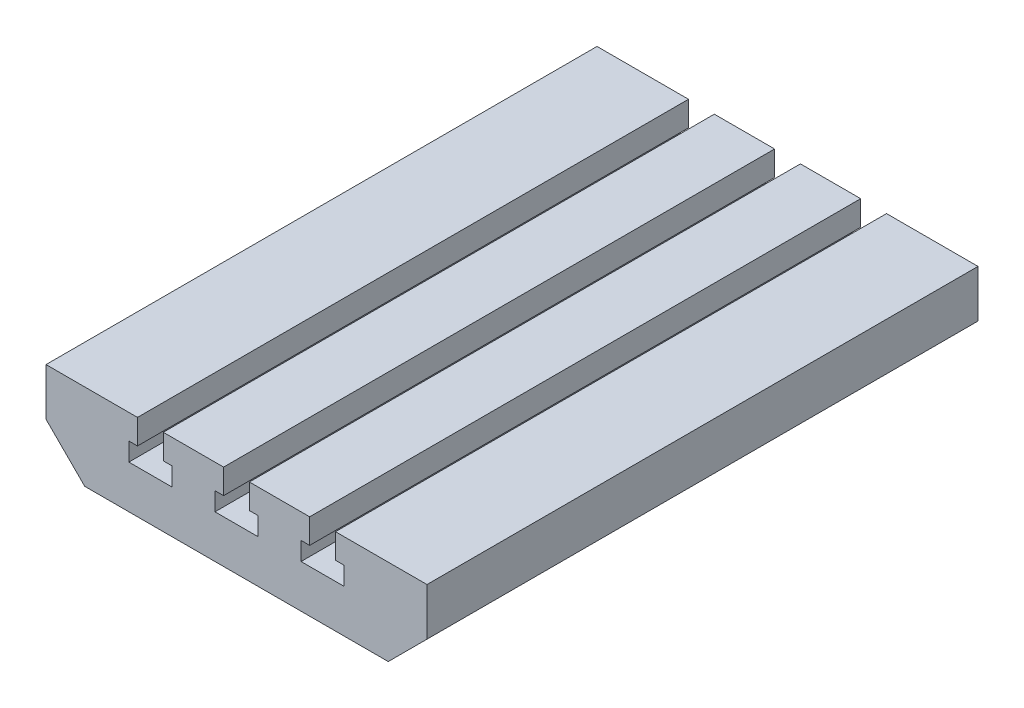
ISO-10303-21;
HEADER;
FILE_DESCRIPTION(('STEP AP214'),'2;1');
FILE_NAME('part.step','',(''),(''),'','','');
FILE_SCHEMA(('AUTOMOTIVE_DESIGN { 1 0 10303 214 1 1 1 1 }'));
ENDSEC;
DATA;
#1=APPLICATION_CONTEXT('core data for automotive mechanical design processes');
#2=APPLICATION_PROTOCOL_DEFINITION('international standard','automotive_design',2000,#1);
#3=PRODUCT_CONTEXT('',#1,'mechanical');
#4=PRODUCT('Part','Part','',(#3));
#5=PRODUCT_RELATED_PRODUCT_CATEGORY('part','',(#4));
#6=PRODUCT_DEFINITION_FORMATION('','',#4);
#7=PRODUCT_DEFINITION_CONTEXT('part definition',#1,'design');
#8=PRODUCT_DEFINITION('design','',#6,#7);
#9=PRODUCT_DEFINITION_SHAPE('','',#8);
#10=(LENGTH_UNIT() NAMED_UNIT(*) SI_UNIT(.MILLI.,.METRE.));
#11=(NAMED_UNIT(*) PLANE_ANGLE_UNIT() SI_UNIT($,.RADIAN.));
#12=(NAMED_UNIT(*) SI_UNIT($,.STERADIAN.) SOLID_ANGLE_UNIT());
#13=UNCERTAINTY_MEASURE_WITH_UNIT(LENGTH_MEASURE(1.E-05),#10,'distance_accuracy_value','');
#14=(GEOMETRIC_REPRESENTATION_CONTEXT(3) GLOBAL_UNCERTAINTY_ASSIGNED_CONTEXT((#13)) GLOBAL_UNIT_ASSIGNED_CONTEXT((#10,
#11,#12)) REPRESENTATION_CONTEXT('',''));
#15=CARTESIAN_POINT('',(0.,0.,0.));
#16=DIRECTION('',(0.,0.,1.));
#17=DIRECTION('',(1.,0.,0.));
#18=AXIS2_PLACEMENT_3D('',#15,#16,#17);
#19=CARTESIAN_POINT('',(-88.5,40.,256.));
#20=DIRECTION('',(1.,0.,0.));
#21=DIRECTION('',(0.,1.,0.));
#22=AXIS2_PLACEMENT_3D('',#19,#20,#21);
#23=PLANE('',#22);
#24=DIRECTION('',(0.,-1.,0.));
#25=VECTOR('',#24,1.);
#26=CARTESIAN_POINT('',(-88.5,40.,0.));
#27=LINE('',#26,#25);
#28=CARTESIAN_POINT('',(-88.5,40.,0.));
#29=VERTEX_POINT('',#28);
#30=CARTESIAN_POINT('',(-88.5,18.,0.));
#31=VERTEX_POINT('',#30);
#32=EDGE_CURVE('E268',#29,#31,#27,.T.);
#33=ORIENTED_EDGE('',*,*,#32,.T.);
#34=DIRECTION('',(0.,0.,-1.));
#35=VECTOR('',#34,1.);
#36=CARTESIAN_POINT('',(-88.5,18.,256.));
#37=LINE('',#36,#35);
#38=CARTESIAN_POINT('',(-88.5,18.,256.));
#39=VERTEX_POINT('',#38);
#40=EDGE_CURVE('E11',#39,#31,#37,.T.);
#41=ORIENTED_EDGE('',*,*,#40,.F.);
#42=DIRECTION('',(0.,-1.,0.));
#43=VECTOR('',#42,1.);
#44=CARTESIAN_POINT('',(-88.5,40.,256.));
#45=LINE('',#44,#43);
#46=CARTESIAN_POINT('',(-88.5,40.,256.));
#47=VERTEX_POINT('',#46);
#48=EDGE_CURVE('E326',#47,#39,#45,.T.);
#49=ORIENTED_EDGE('',*,*,#48,.F.);
#50=DIRECTION('',(0.,0.,-1.));
#51=VECTOR('',#50,1.);
#52=CARTESIAN_POINT('',(-88.5,40.,256.));
#53=LINE('',#52,#51);
#54=EDGE_CURVE('E264',#47,#29,#53,.T.);
#55=ORIENTED_EDGE('',*,*,#54,.T.);
#56=EDGE_LOOP('',(#33,#41,#49,#55));
#57=FACE_BOUND('',#56,.T.);
#58=ADVANCED_FACE('F40',(#57),#23,.F.);
#59=CARTESIAN_POINT('',(-70.5,0.,256.));
#60=DIRECTION('',(0.707106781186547,0.707106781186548,0.));
#61=DIRECTION('',(-0.707106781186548,0.707106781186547,0.));
#62=AXIS2_PLACEMENT_3D('',#59,#60,#61);
#63=PLANE('',#62);
#64=DIRECTION('',(0.707106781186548,-0.707106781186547,0.));
#65=VECTOR('',#64,1.);
#66=CARTESIAN_POINT('',(-70.5,0.,0.));
#67=LINE('',#66,#65);
#68=CARTESIAN_POINT('',(-70.5,0.,0.));
#69=VERTEX_POINT('',#68);
#70=EDGE_CURVE('E271',#31,#69,#67,.T.);
#71=ORIENTED_EDGE('',*,*,#70,.T.);
#72=DIRECTION('',(0.,0.,-1.));
#73=VECTOR('',#72,1.);
#74=CARTESIAN_POINT('',(-70.5,0.,256.));
#75=LINE('',#74,#73);
#76=CARTESIAN_POINT('',(-70.5,0.,256.));
#77=VERTEX_POINT('',#76);
#78=EDGE_CURVE('E48',#77,#69,#75,.T.);
#79=ORIENTED_EDGE('',*,*,#78,.F.);
#80=DIRECTION('',(0.707106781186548,-0.707106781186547,0.));
#81=VECTOR('',#80,1.);
#82=CARTESIAN_POINT('',(-70.5,0.,256.));
#83=LINE('',#82,#81);
#84=EDGE_CURVE('E165',#39,#77,#83,.T.);
#85=ORIENTED_EDGE('',*,*,#84,.F.);
#86=ORIENTED_EDGE('',*,*,#40,.T.);
#87=EDGE_LOOP('',(#71,#79,#85,#86));
#88=FACE_BOUND('',#87,.T.);
#89=ADVANCED_FACE('F494',(#88),#63,.F.);
#90=CARTESIAN_POINT('',(70.5,0.,256.));
#91=DIRECTION('',(0.,1.,0.));
#92=DIRECTION('',(-1.,0.,0.));
#93=AXIS2_PLACEMENT_3D('',#90,#91,#92);
#94=PLANE('',#93);
#95=DIRECTION('',(1.,0.,0.));
#96=VECTOR('',#95,1.);
#97=CARTESIAN_POINT('',(70.5,0.,0.));
#98=LINE('',#97,#96);
#99=CARTESIAN_POINT('',(70.5,0.,0.));
#100=VERTEX_POINT('',#99);
#101=EDGE_CURVE('E273',#69,#100,#98,.T.);
#102=ORIENTED_EDGE('',*,*,#101,.T.);
#103=DIRECTION('',(0.,0.,-1.));
#104=VECTOR('',#103,1.);
#105=CARTESIAN_POINT('',(70.5,0.,256.));
#106=LINE('',#105,#104);
#107=CARTESIAN_POINT('',(70.5,0.,256.));
#108=VERTEX_POINT('',#107);
#109=EDGE_CURVE('E399',#108,#100,#106,.T.);
#110=ORIENTED_EDGE('',*,*,#109,.F.);
#111=DIRECTION('',(1.,0.,0.));
#112=VECTOR('',#111,1.);
#113=CARTESIAN_POINT('',(70.5,0.,256.));
#114=LINE('',#113,#112);
#115=EDGE_CURVE('E407',#77,#108,#114,.T.);
#116=ORIENTED_EDGE('',*,*,#115,.F.);
#117=ORIENTED_EDGE('',*,*,#78,.T.);
#118=EDGE_LOOP('',(#102,#110,#116,#117));
#119=FACE_BOUND('',#118,.T.);
#120=ADVANCED_FACE('F405',(#119),#94,.F.);
#121=CARTESIAN_POINT('',(88.5,18.,256.));
#122=DIRECTION('',(-0.707106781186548,0.707106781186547,0.));
#123=DIRECTION('',(-0.707106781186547,-0.707106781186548,0.));
#124=AXIS2_PLACEMENT_3D('',#121,#122,#123);
#125=PLANE('',#124);
#126=DIRECTION('',(0.707106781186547,0.707106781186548,0.));
#127=VECTOR('',#126,1.);
#128=CARTESIAN_POINT('',(88.5,18.,0.));
#129=LINE('',#128,#127);
#130=CARTESIAN_POINT('',(88.5,18.,0.));
#131=VERTEX_POINT('',#130);
#132=EDGE_CURVE('E275',#100,#131,#129,.T.);
#133=ORIENTED_EDGE('',*,*,#132,.T.);
#134=DIRECTION('',(0.,0.,-1.));
#135=VECTOR('',#134,1.);
#136=CARTESIAN_POINT('',(88.5,18.,256.));
#137=LINE('',#136,#135);
#138=CARTESIAN_POINT('',(88.5,18.,256.));
#139=VERTEX_POINT('',#138);
#140=EDGE_CURVE('E396',#139,#131,#137,.T.);
#141=ORIENTED_EDGE('',*,*,#140,.F.);
#142=DIRECTION('',(0.707106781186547,0.707106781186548,0.));
#143=VECTOR('',#142,1.);
#144=CARTESIAN_POINT('',(88.5,18.,256.));
#145=LINE('',#144,#143);
#146=EDGE_CURVE('E425',#108,#139,#145,.T.);
#147=ORIENTED_EDGE('',*,*,#146,.F.);
#148=ORIENTED_EDGE('',*,*,#109,.T.);
#149=EDGE_LOOP('',(#133,#141,#147,#148));
#150=FACE_BOUND('',#149,.T.);
#151=ADVANCED_FACE('F416',(#150),#125,.F.);
#152=CARTESIAN_POINT('',(88.5,40.,256.));
#153=DIRECTION('',(-1.,0.,0.));
#154=DIRECTION('',(0.,0.,1.));
#155=AXIS2_PLACEMENT_3D('',#152,#153,#154);
#156=PLANE('',#155);
#157=DIRECTION('',(0.,1.,0.));
#158=VECTOR('',#157,1.);
#159=CARTESIAN_POINT('',(88.5,40.,0.));
#160=LINE('',#159,#158);
#161=CARTESIAN_POINT('',(88.5,40.,0.));
#162=VERTEX_POINT('',#161);
#163=EDGE_CURVE('E277',#131,#162,#160,.T.);
#164=ORIENTED_EDGE('',*,*,#163,.T.);
#165=DIRECTION('',(0.,0.,-1.));
#166=VECTOR('',#165,1.);
#167=CARTESIAN_POINT('',(88.5,40.,256.));
#168=LINE('',#167,#166);
#169=CARTESIAN_POINT('',(88.5,40.,256.));
#170=VERTEX_POINT('',#169);
#171=EDGE_CURVE('E393',#170,#162,#168,.T.);
#172=ORIENTED_EDGE('',*,*,#171,.F.);
#173=DIRECTION('',(0.,1.,0.));
#174=VECTOR('',#173,1.);
#175=CARTESIAN_POINT('',(88.5,40.,256.));
#176=LINE('',#175,#174);
#177=EDGE_CURVE('E422',#139,#170,#176,.T.);
#178=ORIENTED_EDGE('',*,*,#177,.F.);
#179=ORIENTED_EDGE('',*,*,#140,.T.);
#180=EDGE_LOOP('',(#164,#172,#178,#179));
#181=FACE_BOUND('',#180,.T.);
#182=ADVANCED_FACE('F420',(#181),#156,.F.);
#183=CARTESIAN_POINT('',(46.,40.,256.));
#184=DIRECTION('',(0.,-1.,0.));
#185=DIRECTION('',(1.,0.,0.));
#186=AXIS2_PLACEMENT_3D('',#183,#184,#185);
#187=PLANE('',#186);
#188=DIRECTION('',(-1.,0.,0.));
#189=VECTOR('',#188,1.);
#190=CARTESIAN_POINT('',(46.,40.,0.));
#191=LINE('',#190,#189);
#192=CARTESIAN_POINT('',(46.,40.,0.));
#193=VERTEX_POINT('',#192);
#194=EDGE_CURVE('E279',#162,#193,#191,.T.);
#195=ORIENTED_EDGE('',*,*,#194,.T.);
#196=DIRECTION('',(0.,0.,-1.));
#197=VECTOR('',#196,1.);
#198=CARTESIAN_POINT('',(46.,40.,256.));
#199=LINE('',#198,#197);
#200=CARTESIAN_POINT('',(46.,40.,256.));
#201=VERTEX_POINT('',#200);
#202=EDGE_CURVE('E390',#201,#193,#199,.T.);
#203=ORIENTED_EDGE('',*,*,#202,.F.);
#204=DIRECTION('',(-1.,0.,0.));
#205=VECTOR('',#204,1.);
#206=CARTESIAN_POINT('',(46.,40.,256.));
#207=LINE('',#206,#205);
#208=EDGE_CURVE('E424',#170,#201,#207,.T.);
#209=ORIENTED_EDGE('',*,*,#208,.F.);
#210=ORIENTED_EDGE('',*,*,#171,.T.);
#211=EDGE_LOOP('',(#195,#203,#209,#210));
#212=FACE_BOUND('',#211,.T.);
#213=ADVANCED_FACE('F507',(#212),#187,.F.);
#214=CARTESIAN_POINT('',(46.,28.5,256.));
#215=DIRECTION('',(1.,0.,0.));
#216=DIRECTION('',(0.,0.,-1.));
#217=AXIS2_PLACEMENT_3D('',#214,#215,#216);
#218=PLANE('',#217);
#219=DIRECTION('',(0.,-1.,0.));
#220=VECTOR('',#219,1.);
#221=CARTESIAN_POINT('',(46.,28.5,0.));
#222=LINE('',#221,#220);
#223=CARTESIAN_POINT('',(46.,28.5,0.));
#224=VERTEX_POINT('',#223);
#225=EDGE_CURVE('E281',#193,#224,#222,.T.);
#226=ORIENTED_EDGE('',*,*,#225,.T.);
#227=DIRECTION('',(0.,0.,-1.));
#228=VECTOR('',#227,1.);
#229=CARTESIAN_POINT('',(46.,28.5,256.));
#230=LINE('',#229,#228);
#231=CARTESIAN_POINT('',(46.,28.5,256.));
#232=VERTEX_POINT('',#231);
#233=EDGE_CURVE('E387',#232,#224,#230,.T.);
#234=ORIENTED_EDGE('',*,*,#233,.F.);
#235=DIRECTION('',(0.,-1.,0.));
#236=VECTOR('',#235,1.);
#237=CARTESIAN_POINT('',(46.,28.5,256.));
#238=LINE('',#237,#236);
#239=EDGE_CURVE('E427',#201,#232,#238,.T.);
#240=ORIENTED_EDGE('',*,*,#239,.F.);
#241=ORIENTED_EDGE('',*,*,#202,.T.);
#242=EDGE_LOOP('',(#226,#234,#240,#241));
#243=FACE_BOUND('',#242,.T.);
#244=ADVANCED_FACE('F510',(#243),#218,.F.);
#245=CARTESIAN_POINT('',(50.,28.5,256.));
#246=DIRECTION('',(0.,1.,0.));
#247=DIRECTION('',(0.,0.,1.));
#248=AXIS2_PLACEMENT_3D('',#245,#246,#247);
#249=PLANE('',#248);
#250=DIRECTION('',(1.,0.,0.));
#251=VECTOR('',#250,1.);
#252=CARTESIAN_POINT('',(50.,28.5,0.));
#253=LINE('',#252,#251);
#254=CARTESIAN_POINT('',(50.,28.5,0.));
#255=VERTEX_POINT('',#254);
#256=EDGE_CURVE('E283',#224,#255,#253,.T.);
#257=ORIENTED_EDGE('',*,*,#256,.T.);
#258=DIRECTION('',(0.,0.,-1.));
#259=VECTOR('',#258,1.);
#260=CARTESIAN_POINT('',(50.,28.5,256.));
#261=LINE('',#260,#259);
#262=CARTESIAN_POINT('',(50.,28.5,256.));
#263=VERTEX_POINT('',#262);
#264=EDGE_CURVE('E384',#263,#255,#261,.T.);
#265=ORIENTED_EDGE('',*,*,#264,.F.);
#266=DIRECTION('',(1.,0.,0.));
#267=VECTOR('',#266,1.);
#268=CARTESIAN_POINT('',(50.,28.5,256.));
#269=LINE('',#268,#267);
#270=EDGE_CURVE('E433',#232,#263,#269,.T.);
#271=ORIENTED_EDGE('',*,*,#270,.F.);
#272=ORIENTED_EDGE('',*,*,#233,.T.);
#273=EDGE_LOOP('',(#257,#265,#271,#272));
#274=FACE_BOUND('',#273,.T.);
#275=ADVANCED_FACE('F514',(#274),#249,.F.);
#276=CARTESIAN_POINT('',(50.,20.,256.));
#277=DIRECTION('',(1.,0.,0.));
#278=DIRECTION('',(0.,1.,0.));
#279=AXIS2_PLACEMENT_3D('',#276,#277,#278);
#280=PLANE('',#279);
#281=DIRECTION('',(0.,-1.,0.));
#282=VECTOR('',#281,1.);
#283=CARTESIAN_POINT('',(50.,20.,0.));
#284=LINE('',#283,#282);
#285=CARTESIAN_POINT('',(50.,20.,0.));
#286=VERTEX_POINT('',#285);
#287=EDGE_CURVE('E285',#255,#286,#284,.T.);
#288=ORIENTED_EDGE('',*,*,#287,.T.);
#289=DIRECTION('',(0.,0.,-1.));
#290=VECTOR('',#289,1.);
#291=CARTESIAN_POINT('',(50.,20.,256.));
#292=LINE('',#291,#290);
#293=CARTESIAN_POINT('',(50.,20.,256.));
#294=VERTEX_POINT('',#293);
#295=EDGE_CURVE('E381',#294,#286,#292,.T.);
#296=ORIENTED_EDGE('',*,*,#295,.F.);
#297=DIRECTION('',(0.,-1.,0.));
#298=VECTOR('',#297,1.);
#299=CARTESIAN_POINT('',(50.,20.,256.));
#300=LINE('',#299,#298);
#301=EDGE_CURVE('E435',#263,#294,#300,.T.);
#302=ORIENTED_EDGE('',*,*,#301,.F.);
#303=ORIENTED_EDGE('',*,*,#264,.T.);
#304=EDGE_LOOP('',(#288,#296,#302,#303));
#305=FACE_BOUND('',#304,.T.);
#306=ADVANCED_FACE('F518',(#305),#280,.F.);
#307=CARTESIAN_POINT('',(30.,20.,256.));
#308=DIRECTION('',(0.,-1.,0.));
#309=DIRECTION('',(1.,0.,0.));
#310=AXIS2_PLACEMENT_3D('',#307,#308,#309);
#311=PLANE('',#310);
#312=DIRECTION('',(-1.,0.,0.));
#313=VECTOR('',#312,1.);
#314=CARTESIAN_POINT('',(30.,20.,0.));
#315=LINE('',#314,#313);
#316=CARTESIAN_POINT('',(30.,20.,0.));
#317=VERTEX_POINT('',#316);
#318=EDGE_CURVE('E287',#286,#317,#315,.T.);
#319=ORIENTED_EDGE('',*,*,#318,.T.);
#320=DIRECTION('',(0.,0.,-1.));
#321=VECTOR('',#320,1.);
#322=CARTESIAN_POINT('',(30.,20.,256.));
#323=LINE('',#322,#321);
#324=CARTESIAN_POINT('',(30.,20.,256.));
#325=VERTEX_POINT('',#324);
#326=EDGE_CURVE('E378',#325,#317,#323,.T.);
#327=ORIENTED_EDGE('',*,*,#326,.F.);
#328=DIRECTION('',(-1.,0.,0.));
#329=VECTOR('',#328,1.);
#330=CARTESIAN_POINT('',(30.,20.,256.));
#331=LINE('',#330,#329);
#332=EDGE_CURVE('E437',#294,#325,#331,.T.);
#333=ORIENTED_EDGE('',*,*,#332,.F.);
#334=ORIENTED_EDGE('',*,*,#295,.T.);
#335=EDGE_LOOP('',(#319,#327,#333,#334));
#336=FACE_BOUND('',#335,.T.);
#337=ADVANCED_FACE('F522',(#336),#311,.F.);
#338=CARTESIAN_POINT('',(30.,28.5,256.));
#339=DIRECTION('',(-1.,0.,0.));
#340=DIRECTION('',(0.,-1.,0.));
#341=AXIS2_PLACEMENT_3D('',#338,#339,#340);
#342=PLANE('',#341);
#343=DIRECTION('',(0.,1.,0.));
#344=VECTOR('',#343,1.);
#345=CARTESIAN_POINT('',(30.,28.5,0.));
#346=LINE('',#345,#344);
#347=CARTESIAN_POINT('',(30.,28.5,0.));
#348=VERTEX_POINT('',#347);
#349=EDGE_CURVE('E289',#317,#348,#346,.T.);
#350=ORIENTED_EDGE('',*,*,#349,.T.);
#351=DIRECTION('',(0.,0.,-1.));
#352=VECTOR('',#351,1.);
#353=CARTESIAN_POINT('',(30.,28.5,256.));
#354=LINE('',#353,#352);
#355=CARTESIAN_POINT('',(30.,28.5,256.));
#356=VERTEX_POINT('',#355);
#357=EDGE_CURVE('E375',#356,#348,#354,.T.);
#358=ORIENTED_EDGE('',*,*,#357,.F.);
#359=DIRECTION('',(0.,1.,0.));
#360=VECTOR('',#359,1.);
#361=CARTESIAN_POINT('',(30.,28.5,256.));
#362=LINE('',#361,#360);
#363=EDGE_CURVE('E439',#325,#356,#362,.T.);
#364=ORIENTED_EDGE('',*,*,#363,.F.);
#365=ORIENTED_EDGE('',*,*,#326,.T.);
#366=EDGE_LOOP('',(#350,#358,#364,#365));
#367=FACE_BOUND('',#366,.T.);
#368=ADVANCED_FACE('F526',(#367),#342,.F.);
#369=CARTESIAN_POINT('',(34.,28.5,256.));
#370=DIRECTION('',(0.,1.,0.));
#371=DIRECTION('',(0.,0.,1.));
#372=AXIS2_PLACEMENT_3D('',#369,#370,#371);
#373=PLANE('',#372);
#374=DIRECTION('',(1.,0.,0.));
#375=VECTOR('',#374,1.);
#376=CARTESIAN_POINT('',(34.,28.5,0.));
#377=LINE('',#376,#375);
#378=CARTESIAN_POINT('',(34.,28.5,0.));
#379=VERTEX_POINT('',#378);
#380=EDGE_CURVE('E291',#348,#379,#377,.T.);
#381=ORIENTED_EDGE('',*,*,#380,.T.);
#382=DIRECTION('',(0.,0.,-1.));
#383=VECTOR('',#382,1.);
#384=CARTESIAN_POINT('',(34.,28.5,256.));
#385=LINE('',#384,#383);
#386=CARTESIAN_POINT('',(34.,28.5,256.));
#387=VERTEX_POINT('',#386);
#388=EDGE_CURVE('E372',#387,#379,#385,.T.);
#389=ORIENTED_EDGE('',*,*,#388,.F.);
#390=DIRECTION('',(1.,0.,0.));
#391=VECTOR('',#390,1.);
#392=CARTESIAN_POINT('',(34.,28.5,256.));
#393=LINE('',#392,#391);
#394=EDGE_CURVE('E441',#356,#387,#393,.T.);
#395=ORIENTED_EDGE('',*,*,#394,.F.);
#396=ORIENTED_EDGE('',*,*,#357,.T.);
#397=EDGE_LOOP('',(#381,#389,#395,#396));
#398=FACE_BOUND('',#397,.T.);
#399=ADVANCED_FACE('F530',(#398),#373,.F.);
#400=CARTESIAN_POINT('',(34.,40.,256.));
#401=DIRECTION('',(-1.,0.,0.));
#402=DIRECTION('',(0.,0.,1.));
#403=AXIS2_PLACEMENT_3D('',#400,#401,#402);
#404=PLANE('',#403);
#405=DIRECTION('',(0.,1.,0.));
#406=VECTOR('',#405,1.);
#407=CARTESIAN_POINT('',(34.,40.,0.));
#408=LINE('',#407,#406);
#409=CARTESIAN_POINT('',(34.,40.,0.));
#410=VERTEX_POINT('',#409);
#411=EDGE_CURVE('E293',#379,#410,#408,.T.);
#412=ORIENTED_EDGE('',*,*,#411,.T.);
#413=DIRECTION('',(0.,0.,-1.));
#414=VECTOR('',#413,1.);
#415=CARTESIAN_POINT('',(34.,40.,256.));
#416=LINE('',#415,#414);
#417=CARTESIAN_POINT('',(34.,40.,256.));
#418=VERTEX_POINT('',#417);
#419=EDGE_CURVE('E369',#418,#410,#416,.T.);
#420=ORIENTED_EDGE('',*,*,#419,.F.);
#421=DIRECTION('',(0.,1.,0.));
#422=VECTOR('',#421,1.);
#423=CARTESIAN_POINT('',(34.,40.,256.));
#424=LINE('',#423,#422);
#425=EDGE_CURVE('E443',#387,#418,#424,.T.);
#426=ORIENTED_EDGE('',*,*,#425,.F.);
#427=ORIENTED_EDGE('',*,*,#388,.T.);
#428=EDGE_LOOP('',(#412,#420,#426,#427));
#429=FACE_BOUND('',#428,.T.);
#430=ADVANCED_FACE('F534',(#429),#404,.F.);
#431=CARTESIAN_POINT('',(6.,40.,256.));
#432=DIRECTION('',(0.,-1.,0.));
#433=DIRECTION('',(1.,0.,0.));
#434=AXIS2_PLACEMENT_3D('',#431,#432,#433);
#435=PLANE('',#434);
#436=DIRECTION('',(-1.,0.,0.));
#437=VECTOR('',#436,1.);
#438=CARTESIAN_POINT('',(6.,40.,0.));
#439=LINE('',#438,#437);
#440=CARTESIAN_POINT('',(6.,40.,0.));
#441=VERTEX_POINT('',#440);
#442=EDGE_CURVE('E295',#410,#441,#439,.T.);
#443=ORIENTED_EDGE('',*,*,#442,.T.);
#444=DIRECTION('',(0.,0.,-1.));
#445=VECTOR('',#444,1.);
#446=CARTESIAN_POINT('',(6.,40.,256.));
#447=LINE('',#446,#445);
#448=CARTESIAN_POINT('',(6.,40.,256.));
#449=VERTEX_POINT('',#448);
#450=EDGE_CURVE('E366',#449,#441,#447,.T.);
#451=ORIENTED_EDGE('',*,*,#450,.F.);
#452=DIRECTION('',(-1.,0.,0.));
#453=VECTOR('',#452,1.);
#454=CARTESIAN_POINT('',(6.,40.,256.));
#455=LINE('',#454,#453);
#456=EDGE_CURVE('E445',#418,#449,#455,.T.);
#457=ORIENTED_EDGE('',*,*,#456,.F.);
#458=ORIENTED_EDGE('',*,*,#419,.T.);
#459=EDGE_LOOP('',(#443,#451,#457,#458));
#460=FACE_BOUND('',#459,.T.);
#461=ADVANCED_FACE('F538',(#460),#435,.F.);
#462=CARTESIAN_POINT('',(6.,28.5,256.));
#463=DIRECTION('',(1.,0.,0.));
#464=DIRECTION('',(0.,0.,-1.));
#465=AXIS2_PLACEMENT_3D('',#462,#463,#464);
#466=PLANE('',#465);
#467=DIRECTION('',(0.,-1.,0.));
#468=VECTOR('',#467,1.);
#469=CARTESIAN_POINT('',(6.,28.5,0.));
#470=LINE('',#469,#468);
#471=CARTESIAN_POINT('',(6.,28.5,0.));
#472=VERTEX_POINT('',#471);
#473=EDGE_CURVE('E297',#441,#472,#470,.T.);
#474=ORIENTED_EDGE('',*,*,#473,.T.);
#475=DIRECTION('',(0.,0.,-1.));
#476=VECTOR('',#475,1.);
#477=CARTESIAN_POINT('',(6.,28.5,256.));
#478=LINE('',#477,#476);
#479=CARTESIAN_POINT('',(6.,28.5,256.));
#480=VERTEX_POINT('',#479);
#481=EDGE_CURVE('E363',#480,#472,#478,.T.);
#482=ORIENTED_EDGE('',*,*,#481,.F.);
#483=DIRECTION('',(0.,-1.,0.));
#484=VECTOR('',#483,1.);
#485=CARTESIAN_POINT('',(6.,28.5,256.));
#486=LINE('',#485,#484);
#487=EDGE_CURVE('E447',#449,#480,#486,.T.);
#488=ORIENTED_EDGE('',*,*,#487,.F.);
#489=ORIENTED_EDGE('',*,*,#450,.T.);
#490=EDGE_LOOP('',(#474,#482,#488,#489));
#491=FACE_BOUND('',#490,.T.);
#492=ADVANCED_FACE('F542',(#491),#466,.F.);
#493=CARTESIAN_POINT('',(10.,28.5,256.));
#494=DIRECTION('',(0.,1.,0.));
#495=DIRECTION('',(0.,0.,1.));
#496=AXIS2_PLACEMENT_3D('',#493,#494,#495);
#497=PLANE('',#496);
#498=DIRECTION('',(1.,0.,0.));
#499=VECTOR('',#498,1.);
#500=CARTESIAN_POINT('',(10.,28.5,0.));
#501=LINE('',#500,#499);
#502=CARTESIAN_POINT('',(10.,28.5,0.));
#503=VERTEX_POINT('',#502);
#504=EDGE_CURVE('E299',#472,#503,#501,.T.);
#505=ORIENTED_EDGE('',*,*,#504,.T.);
#506=DIRECTION('',(0.,0.,-1.));
#507=VECTOR('',#506,1.);
#508=CARTESIAN_POINT('',(10.,28.5,256.));
#509=LINE('',#508,#507);
#510=CARTESIAN_POINT('',(10.,28.5,256.));
#511=VERTEX_POINT('',#510);
#512=EDGE_CURVE('E360',#511,#503,#509,.T.);
#513=ORIENTED_EDGE('',*,*,#512,.F.);
#514=DIRECTION('',(1.,0.,0.));
#515=VECTOR('',#514,1.);
#516=CARTESIAN_POINT('',(10.,28.5,256.));
#517=LINE('',#516,#515);
#518=EDGE_CURVE('E449',#480,#511,#517,.T.);
#519=ORIENTED_EDGE('',*,*,#518,.F.);
#520=ORIENTED_EDGE('',*,*,#481,.T.);
#521=EDGE_LOOP('',(#505,#513,#519,#520));
#522=FACE_BOUND('',#521,.T.);
#523=ADVANCED_FACE('F546',(#522),#497,.F.);
#524=CARTESIAN_POINT('',(10.,20.,256.));
#525=DIRECTION('',(1.,0.,0.));
#526=DIRECTION('',(0.,1.,0.));
#527=AXIS2_PLACEMENT_3D('',#524,#525,#526);
#528=PLANE('',#527);
#529=DIRECTION('',(0.,-1.,0.));
#530=VECTOR('',#529,1.);
#531=CARTESIAN_POINT('',(10.,20.,0.));
#532=LINE('',#531,#530);
#533=CARTESIAN_POINT('',(10.,20.,0.));
#534=VERTEX_POINT('',#533);
#535=EDGE_CURVE('E301',#503,#534,#532,.T.);
#536=ORIENTED_EDGE('',*,*,#535,.T.);
#537=DIRECTION('',(0.,0.,-1.));
#538=VECTOR('',#537,1.);
#539=CARTESIAN_POINT('',(10.,20.,256.));
#540=LINE('',#539,#538);
#541=CARTESIAN_POINT('',(10.,20.,256.));
#542=VERTEX_POINT('',#541);
#543=EDGE_CURVE('E357',#542,#534,#540,.T.);
#544=ORIENTED_EDGE('',*,*,#543,.F.);
#545=DIRECTION('',(0.,-1.,0.));
#546=VECTOR('',#545,1.);
#547=CARTESIAN_POINT('',(10.,20.,256.));
#548=LINE('',#547,#546);
#549=EDGE_CURVE('E451',#511,#542,#548,.T.);
#550=ORIENTED_EDGE('',*,*,#549,.F.);
#551=ORIENTED_EDGE('',*,*,#512,.T.);
#552=EDGE_LOOP('',(#536,#544,#550,#551));
#553=FACE_BOUND('',#552,.T.);
#554=ADVANCED_FACE('F550',(#553),#528,.F.);
#555=CARTESIAN_POINT('',(-10.,20.,256.));
#556=DIRECTION('',(0.,-1.,0.));
#557=DIRECTION('',(0.,0.,-1.));
#558=AXIS2_PLACEMENT_3D('',#555,#556,#557);
#559=PLANE('',#558);
#560=DIRECTION('',(-1.,0.,0.));
#561=VECTOR('',#560,1.);
#562=CARTESIAN_POINT('',(-10.,20.,0.));
#563=LINE('',#562,#561);
#564=CARTESIAN_POINT('',(-10.,20.,0.));
#565=VERTEX_POINT('',#564);
#566=EDGE_CURVE('E303',#534,#565,#563,.T.);
#567=ORIENTED_EDGE('',*,*,#566,.T.);
#568=DIRECTION('',(0.,0.,-1.));
#569=VECTOR('',#568,1.);
#570=CARTESIAN_POINT('',(-10.,20.,256.));
#571=LINE('',#570,#569);
#572=CARTESIAN_POINT('',(-10.,20.,256.));
#573=VERTEX_POINT('',#572);
#574=EDGE_CURVE('E354',#573,#565,#571,.T.);
#575=ORIENTED_EDGE('',*,*,#574,.F.);
#576=DIRECTION('',(-1.,0.,0.));
#577=VECTOR('',#576,1.);
#578=CARTESIAN_POINT('',(-10.,20.,256.));
#579=LINE('',#578,#577);
#580=EDGE_CURVE('E453',#542,#573,#579,.T.);
#581=ORIENTED_EDGE('',*,*,#580,.F.);
#582=ORIENTED_EDGE('',*,*,#543,.T.);
#583=EDGE_LOOP('',(#567,#575,#581,#582));
#584=FACE_BOUND('',#583,.T.);
#585=ADVANCED_FACE('F554',(#584),#559,.F.);
#586=CARTESIAN_POINT('',(-10.,28.5,256.));
#587=DIRECTION('',(-1.,0.,0.));
#588=DIRECTION('',(0.,-1.,0.));
#589=AXIS2_PLACEMENT_3D('',#586,#587,#588);
#590=PLANE('',#589);
#591=DIRECTION('',(0.,1.,0.));
#592=VECTOR('',#591,1.);
#593=CARTESIAN_POINT('',(-10.,28.5,0.));
#594=LINE('',#593,#592);
#595=CARTESIAN_POINT('',(-10.,28.5,0.));
#596=VERTEX_POINT('',#595);
#597=EDGE_CURVE('E305',#565,#596,#594,.T.);
#598=ORIENTED_EDGE('',*,*,#597,.T.);
#599=DIRECTION('',(0.,0.,-1.));
#600=VECTOR('',#599,1.);
#601=CARTESIAN_POINT('',(-10.,28.5,256.));
#602=LINE('',#601,#600);
#603=CARTESIAN_POINT('',(-10.,28.5,256.));
#604=VERTEX_POINT('',#603);
#605=EDGE_CURVE('E351',#604,#596,#602,.T.);
#606=ORIENTED_EDGE('',*,*,#605,.F.);
#607=DIRECTION('',(0.,1.,0.));
#608=VECTOR('',#607,1.);
#609=CARTESIAN_POINT('',(-10.,28.5,256.));
#610=LINE('',#609,#608);
#611=EDGE_CURVE('E455',#573,#604,#610,.T.);
#612=ORIENTED_EDGE('',*,*,#611,.F.);
#613=ORIENTED_EDGE('',*,*,#574,.T.);
#614=EDGE_LOOP('',(#598,#606,#612,#613));
#615=FACE_BOUND('',#614,.T.);
#616=ADVANCED_FACE('F558',(#615),#590,.F.);
#617=CARTESIAN_POINT('',(-6.,28.5,256.));
#618=DIRECTION('',(0.,1.,0.));
#619=DIRECTION('',(0.,0.,1.));
#620=AXIS2_PLACEMENT_3D('',#617,#618,#619);
#621=PLANE('',#620);
#622=DIRECTION('',(1.,0.,0.));
#623=VECTOR('',#622,1.);
#624=CARTESIAN_POINT('',(-6.,28.5,0.));
#625=LINE('',#624,#623);
#626=CARTESIAN_POINT('',(-6.,28.5,0.));
#627=VERTEX_POINT('',#626);
#628=EDGE_CURVE('E307',#596,#627,#625,.T.);
#629=ORIENTED_EDGE('',*,*,#628,.T.);
#630=DIRECTION('',(0.,0.,-1.));
#631=VECTOR('',#630,1.);
#632=CARTESIAN_POINT('',(-6.,28.5,256.));
#633=LINE('',#632,#631);
#634=CARTESIAN_POINT('',(-6.,28.5,256.));
#635=VERTEX_POINT('',#634);
#636=EDGE_CURVE('E348',#635,#627,#633,.T.);
#637=ORIENTED_EDGE('',*,*,#636,.F.);
#638=DIRECTION('',(1.,0.,0.));
#639=VECTOR('',#638,1.);
#640=CARTESIAN_POINT('',(-6.,28.5,256.));
#641=LINE('',#640,#639);
#642=EDGE_CURVE('E457',#604,#635,#641,.T.);
#643=ORIENTED_EDGE('',*,*,#642,.F.);
#644=ORIENTED_EDGE('',*,*,#605,.T.);
#645=EDGE_LOOP('',(#629,#637,#643,#644));
#646=FACE_BOUND('',#645,.T.);
#647=ADVANCED_FACE('F562',(#646),#621,.F.);
#648=CARTESIAN_POINT('',(-6.,40.,256.));
#649=DIRECTION('',(-1.,0.,0.));
#650=DIRECTION('',(0.,-1.,0.));
#651=AXIS2_PLACEMENT_3D('',#648,#649,#650);
#652=PLANE('',#651);
#653=DIRECTION('',(0.,1.,0.));
#654=VECTOR('',#653,1.);
#655=CARTESIAN_POINT('',(-6.,40.,0.));
#656=LINE('',#655,#654);
#657=CARTESIAN_POINT('',(-6.,40.,0.));
#658=VERTEX_POINT('',#657);
#659=EDGE_CURVE('E309',#627,#658,#656,.T.);
#660=ORIENTED_EDGE('',*,*,#659,.T.);
#661=DIRECTION('',(0.,0.,-1.));
#662=VECTOR('',#661,1.);
#663=CARTESIAN_POINT('',(-6.,40.,256.));
#664=LINE('',#663,#662);
#665=CARTESIAN_POINT('',(-6.,40.,256.));
#666=VERTEX_POINT('',#665);
#667=EDGE_CURVE('E345',#666,#658,#664,.T.);
#668=ORIENTED_EDGE('',*,*,#667,.F.);
#669=DIRECTION('',(0.,1.,0.));
#670=VECTOR('',#669,1.);
#671=CARTESIAN_POINT('',(-6.,40.,256.));
#672=LINE('',#671,#670);
#673=EDGE_CURVE('E459',#635,#666,#672,.T.);
#674=ORIENTED_EDGE('',*,*,#673,.F.);
#675=ORIENTED_EDGE('',*,*,#636,.T.);
#676=EDGE_LOOP('',(#660,#668,#674,#675));
#677=FACE_BOUND('',#676,.T.);
#678=ADVANCED_FACE('F566',(#677),#652,.F.);
#679=CARTESIAN_POINT('',(-34.,40.,256.));
#680=DIRECTION('',(0.,-1.,0.));
#681=DIRECTION('',(1.,0.,0.));
#682=AXIS2_PLACEMENT_3D('',#679,#680,#681);
#683=PLANE('',#682);
#684=DIRECTION('',(-1.,0.,0.));
#685=VECTOR('',#684,1.);
#686=CARTESIAN_POINT('',(-34.,40.,0.));
#687=LINE('',#686,#685);
#688=CARTESIAN_POINT('',(-34.,40.,0.));
#689=VERTEX_POINT('',#688);
#690=EDGE_CURVE('E311',#658,#689,#687,.T.);
#691=ORIENTED_EDGE('',*,*,#690,.T.);
#692=DIRECTION('',(0.,0.,-1.));
#693=VECTOR('',#692,1.);
#694=CARTESIAN_POINT('',(-34.,40.,256.));
#695=LINE('',#694,#693);
#696=CARTESIAN_POINT('',(-34.,40.,256.));
#697=VERTEX_POINT('',#696);
#698=EDGE_CURVE('E342',#697,#689,#695,.T.);
#699=ORIENTED_EDGE('',*,*,#698,.F.);
#700=DIRECTION('',(-1.,0.,0.));
#701=VECTOR('',#700,1.);
#702=CARTESIAN_POINT('',(-34.,40.,256.));
#703=LINE('',#702,#701);
#704=EDGE_CURVE('E461',#666,#697,#703,.T.);
#705=ORIENTED_EDGE('',*,*,#704,.F.);
#706=ORIENTED_EDGE('',*,*,#667,.T.);
#707=EDGE_LOOP('',(#691,#699,#705,#706));
#708=FACE_BOUND('',#707,.T.);
#709=ADVANCED_FACE('F570',(#708),#683,.F.);
#710=CARTESIAN_POINT('',(-34.,28.5,256.));
#711=DIRECTION('',(1.,0.,0.));
#712=DIRECTION('',(0.,0.,-1.));
#713=AXIS2_PLACEMENT_3D('',#710,#711,#712);
#714=PLANE('',#713);
#715=DIRECTION('',(0.,-1.,0.));
#716=VECTOR('',#715,1.);
#717=CARTESIAN_POINT('',(-34.,28.5,0.));
#718=LINE('',#717,#716);
#719=CARTESIAN_POINT('',(-34.,28.5,0.));
#720=VERTEX_POINT('',#719);
#721=EDGE_CURVE('E313',#689,#720,#718,.T.);
#722=ORIENTED_EDGE('',*,*,#721,.T.);
#723=DIRECTION('',(0.,0.,-1.));
#724=VECTOR('',#723,1.);
#725=CARTESIAN_POINT('',(-34.,28.5,256.));
#726=LINE('',#725,#724);
#727=CARTESIAN_POINT('',(-34.,28.5,256.));
#728=VERTEX_POINT('',#727);
#729=EDGE_CURVE('E339',#728,#720,#726,.T.);
#730=ORIENTED_EDGE('',*,*,#729,.F.);
#731=DIRECTION('',(0.,-1.,0.));
#732=VECTOR('',#731,1.);
#733=CARTESIAN_POINT('',(-34.,28.5,256.));
#734=LINE('',#733,#732);
#735=EDGE_CURVE('E463',#697,#728,#734,.T.);
#736=ORIENTED_EDGE('',*,*,#735,.F.);
#737=ORIENTED_EDGE('',*,*,#698,.T.);
#738=EDGE_LOOP('',(#722,#730,#736,#737));
#739=FACE_BOUND('',#738,.T.);
#740=ADVANCED_FACE('F574',(#739),#714,.F.);
#741=CARTESIAN_POINT('',(-30.,28.5,256.));
#742=DIRECTION('',(0.,1.,0.));
#743=DIRECTION('',(0.,0.,1.));
#744=AXIS2_PLACEMENT_3D('',#741,#742,#743);
#745=PLANE('',#744);
#746=DIRECTION('',(1.,0.,0.));
#747=VECTOR('',#746,1.);
#748=CARTESIAN_POINT('',(-30.,28.5,0.));
#749=LINE('',#748,#747);
#750=CARTESIAN_POINT('',(-30.,28.5,0.));
#751=VERTEX_POINT('',#750);
#752=EDGE_CURVE('E315',#720,#751,#749,.T.);
#753=ORIENTED_EDGE('',*,*,#752,.T.);
#754=DIRECTION('',(0.,0.,-1.));
#755=VECTOR('',#754,1.);
#756=CARTESIAN_POINT('',(-30.,28.5,256.));
#757=LINE('',#756,#755);
#758=CARTESIAN_POINT('',(-30.,28.5,256.));
#759=VERTEX_POINT('',#758);
#760=EDGE_CURVE('E336',#759,#751,#757,.T.);
#761=ORIENTED_EDGE('',*,*,#760,.F.);
#762=DIRECTION('',(1.,0.,0.));
#763=VECTOR('',#762,1.);
#764=CARTESIAN_POINT('',(-30.,28.5,256.));
#765=LINE('',#764,#763);
#766=EDGE_CURVE('E465',#728,#759,#765,.T.);
#767=ORIENTED_EDGE('',*,*,#766,.F.);
#768=ORIENTED_EDGE('',*,*,#729,.T.);
#769=EDGE_LOOP('',(#753,#761,#767,#768));
#770=FACE_BOUND('',#769,.T.);
#771=ADVANCED_FACE('F578',(#770),#745,.F.);
#772=CARTESIAN_POINT('',(-30.,20.,256.));
#773=DIRECTION('',(1.,0.,0.));
#774=DIRECTION('',(0.,1.,0.));
#775=AXIS2_PLACEMENT_3D('',#772,#773,#774);
#776=PLANE('',#775);
#777=DIRECTION('',(0.,-1.,0.));
#778=VECTOR('',#777,1.);
#779=CARTESIAN_POINT('',(-30.,20.,0.));
#780=LINE('',#779,#778);
#781=CARTESIAN_POINT('',(-30.,20.,0.));
#782=VERTEX_POINT('',#781);
#783=EDGE_CURVE('E317',#751,#782,#780,.T.);
#784=ORIENTED_EDGE('',*,*,#783,.T.);
#785=DIRECTION('',(0.,0.,-1.));
#786=VECTOR('',#785,1.);
#787=CARTESIAN_POINT('',(-30.,20.,256.));
#788=LINE('',#787,#786);
#789=CARTESIAN_POINT('',(-30.,20.,256.));
#790=VERTEX_POINT('',#789);
#791=EDGE_CURVE('E333',#790,#782,#788,.T.);
#792=ORIENTED_EDGE('',*,*,#791,.F.);
#793=DIRECTION('',(0.,-1.,0.));
#794=VECTOR('',#793,1.);
#795=CARTESIAN_POINT('',(-30.,20.,256.));
#796=LINE('',#795,#794);
#797=EDGE_CURVE('E467',#759,#790,#796,.T.);
#798=ORIENTED_EDGE('',*,*,#797,.F.);
#799=ORIENTED_EDGE('',*,*,#760,.T.);
#800=EDGE_LOOP('',(#784,#792,#798,#799));
#801=FACE_BOUND('',#800,.T.);
#802=ADVANCED_FACE('F582',(#801),#776,.F.);
#803=CARTESIAN_POINT('',(-50.,20.,256.));
#804=DIRECTION('',(0.,-1.,0.));
#805=DIRECTION('',(1.,0.,0.));
#806=AXIS2_PLACEMENT_3D('',#803,#804,#805);
#807=PLANE('',#806);
#808=DIRECTION('',(-1.,0.,0.));
#809=VECTOR('',#808,1.);
#810=CARTESIAN_POINT('',(-50.,20.,0.));
#811=LINE('',#810,#809);
#812=CARTESIAN_POINT('',(-50.,20.,0.));
#813=VERTEX_POINT('',#812);
#814=EDGE_CURVE('E319',#782,#813,#811,.T.);
#815=ORIENTED_EDGE('',*,*,#814,.T.);
#816=DIRECTION('',(0.,0.,-1.));
#817=VECTOR('',#816,1.);
#818=CARTESIAN_POINT('',(-50.,20.,256.));
#819=LINE('',#818,#817);
#820=CARTESIAN_POINT('',(-50.,20.,256.));
#821=VERTEX_POINT('',#820);
#822=EDGE_CURVE('E330',#821,#813,#819,.T.);
#823=ORIENTED_EDGE('',*,*,#822,.F.);
#824=DIRECTION('',(-1.,0.,0.));
#825=VECTOR('',#824,1.);
#826=CARTESIAN_POINT('',(-50.,20.,256.));
#827=LINE('',#826,#825);
#828=EDGE_CURVE('E469',#790,#821,#827,.T.);
#829=ORIENTED_EDGE('',*,*,#828,.F.);
#830=ORIENTED_EDGE('',*,*,#791,.T.);
#831=EDGE_LOOP('',(#815,#823,#829,#830));
#832=FACE_BOUND('',#831,.T.);
#833=ADVANCED_FACE('F475',(#832),#807,.F.);
#834=CARTESIAN_POINT('',(-50.,28.5,256.));
#835=DIRECTION('',(-1.,0.,0.));
#836=DIRECTION('',(0.,-1.,0.));
#837=AXIS2_PLACEMENT_3D('',#834,#835,#836);
#838=PLANE('',#837);
#839=DIRECTION('',(0.,1.,0.));
#840=VECTOR('',#839,1.);
#841=CARTESIAN_POINT('',(-50.,28.5,0.));
#842=LINE('',#841,#840);
#843=CARTESIAN_POINT('',(-50.,28.5,0.));
#844=VERTEX_POINT('',#843);
#845=EDGE_CURVE('E321',#813,#844,#842,.T.);
#846=ORIENTED_EDGE('',*,*,#845,.T.);
#847=DIRECTION('',(0.,0.,-1.));
#848=VECTOR('',#847,1.);
#849=CARTESIAN_POINT('',(-50.,28.5,256.));
#850=LINE('',#849,#848);
#851=CARTESIAN_POINT('',(-50.,28.5,256.));
#852=VERTEX_POINT('',#851);
#853=EDGE_CURVE('E259',#852,#844,#850,.T.);
#854=ORIENTED_EDGE('',*,*,#853,.F.);
#855=DIRECTION('',(0.,1.,0.));
#856=VECTOR('',#855,1.);
#857=CARTESIAN_POINT('',(-50.,28.5,256.));
#858=LINE('',#857,#856);
#859=EDGE_CURVE('E250',#821,#852,#858,.T.);
#860=ORIENTED_EDGE('',*,*,#859,.F.);
#861=ORIENTED_EDGE('',*,*,#822,.T.);
#862=EDGE_LOOP('',(#846,#854,#860,#861));
#863=FACE_BOUND('',#862,.T.);
#864=ADVANCED_FACE('F479',(#863),#838,.F.);
#865=CARTESIAN_POINT('',(-46.,28.5,256.));
#866=DIRECTION('',(0.,1.,0.));
#867=DIRECTION('',(-1.,0.,0.));
#868=AXIS2_PLACEMENT_3D('',#865,#866,#867);
#869=PLANE('',#868);
#870=DIRECTION('',(1.,0.,0.));
#871=VECTOR('',#870,1.);
#872=CARTESIAN_POINT('',(-46.,28.5,0.));
#873=LINE('',#872,#871);
#874=CARTESIAN_POINT('',(-46.,28.5,0.));
#875=VERTEX_POINT('',#874);
#876=EDGE_CURVE('E258',#844,#875,#873,.T.);
#877=ORIENTED_EDGE('',*,*,#876,.T.);
#878=DIRECTION('',(0.,0.,-1.));
#879=VECTOR('',#878,1.);
#880=CARTESIAN_POINT('',(-46.,28.5,256.));
#881=LINE('',#880,#879);
#882=CARTESIAN_POINT('',(-46.,28.5,256.));
#883=VERTEX_POINT('',#882);
#884=EDGE_CURVE('E255',#883,#875,#881,.T.);
#885=ORIENTED_EDGE('',*,*,#884,.F.);
#886=DIRECTION('',(1.,0.,0.));
#887=VECTOR('',#886,1.);
#888=CARTESIAN_POINT('',(-46.,28.5,256.));
#889=LINE('',#888,#887);
#890=EDGE_CURVE('E244',#852,#883,#889,.T.);
#891=ORIENTED_EDGE('',*,*,#890,.F.);
#892=ORIENTED_EDGE('',*,*,#853,.T.);
#893=EDGE_LOOP('',(#877,#885,#891,#892));
#894=FACE_BOUND('',#893,.T.);
#895=ADVANCED_FACE('F256',(#894),#869,.F.);
#896=CARTESIAN_POINT('',(-46.,40.,256.));
#897=DIRECTION('',(-1.,0.,0.));
#898=DIRECTION('',(0.,0.,1.));
#899=AXIS2_PLACEMENT_3D('',#896,#897,#898);
#900=PLANE('',#899);
#901=DIRECTION('',(0.,1.,0.));
#902=VECTOR('',#901,1.);
#903=CARTESIAN_POINT('',(-46.,40.,0.));
#904=LINE('',#903,#902);
#905=CARTESIAN_POINT('',(-46.,40.,0.));
#906=VERTEX_POINT('',#905);
#907=EDGE_CURVE('E151',#875,#906,#904,.T.);
#908=ORIENTED_EDGE('',*,*,#907,.T.);
#909=DIRECTION('',(0.,0.,-1.));
#910=VECTOR('',#909,1.);
#911=CARTESIAN_POINT('',(-46.,40.,256.));
#912=LINE('',#911,#910);
#913=CARTESIAN_POINT('',(-46.,40.,256.));
#914=VERTEX_POINT('',#913);
#915=EDGE_CURVE('E260',#914,#906,#912,.T.);
#916=ORIENTED_EDGE('',*,*,#915,.F.);
#917=DIRECTION('',(0.,1.,0.));
#918=VECTOR('',#917,1.);
#919=CARTESIAN_POINT('',(-46.,40.,256.));
#920=LINE('',#919,#918);
#921=EDGE_CURVE('E248',#883,#914,#920,.T.);
#922=ORIENTED_EDGE('',*,*,#921,.F.);
#923=ORIENTED_EDGE('',*,*,#884,.T.);
#924=EDGE_LOOP('',(#908,#916,#922,#923));
#925=FACE_BOUND('',#924,.T.);
#926=ADVANCED_FACE('F262',(#925),#900,.F.);
#927=CARTESIAN_POINT('',(-88.5,40.,256.));
#928=DIRECTION('',(0.,-1.,0.));
#929=DIRECTION('',(1.,0.,0.));
#930=AXIS2_PLACEMENT_3D('',#927,#928,#929);
#931=PLANE('',#930);
#932=DIRECTION('',(-1.,0.,0.));
#933=VECTOR('',#932,1.);
#934=CARTESIAN_POINT('',(-88.5,40.,0.));
#935=LINE('',#934,#933);
#936=EDGE_CURVE('E157',#906,#29,#935,.T.);
#937=ORIENTED_EDGE('',*,*,#936,.T.);
#938=ORIENTED_EDGE('',*,*,#54,.F.);
#939=DIRECTION('',(-1.,0.,0.));
#940=VECTOR('',#939,1.);
#941=CARTESIAN_POINT('',(-88.5,40.,256.));
#942=LINE('',#941,#940);
#943=EDGE_CURVE('E56',#914,#47,#942,.T.);
#944=ORIENTED_EDGE('',*,*,#943,.F.);
#945=ORIENTED_EDGE('',*,*,#915,.T.);
#946=EDGE_LOOP('',(#937,#938,#944,#945));
#947=FACE_BOUND('',#946,.T.);
#948=ADVANCED_FACE('F483',(#947),#931,.F.);
#949=CARTESIAN_POINT('',(0.,0.,256.));
#950=DIRECTION('',(0.,0.,-1.));
#951=DIRECTION('',(-1.,0.,0.));
#952=AXIS2_PLACEMENT_3D('',#949,#950,#951);
#953=PLANE('',#952);
#954=ORIENTED_EDGE('',*,*,#48,.T.);
#955=ORIENTED_EDGE('',*,*,#84,.T.);
#956=ORIENTED_EDGE('',*,*,#115,.T.);
#957=ORIENTED_EDGE('',*,*,#146,.T.);
#958=ORIENTED_EDGE('',*,*,#177,.T.);
#959=ORIENTED_EDGE('',*,*,#208,.T.);
#960=ORIENTED_EDGE('',*,*,#239,.T.);
#961=ORIENTED_EDGE('',*,*,#270,.T.);
#962=ORIENTED_EDGE('',*,*,#301,.T.);
#963=ORIENTED_EDGE('',*,*,#332,.T.);
#964=ORIENTED_EDGE('',*,*,#363,.T.);
#965=ORIENTED_EDGE('',*,*,#394,.T.);
#966=ORIENTED_EDGE('',*,*,#425,.T.);
#967=ORIENTED_EDGE('',*,*,#456,.T.);
#968=ORIENTED_EDGE('',*,*,#487,.T.);
#969=ORIENTED_EDGE('',*,*,#518,.T.);
#970=ORIENTED_EDGE('',*,*,#549,.T.);
#971=ORIENTED_EDGE('',*,*,#580,.T.);
#972=ORIENTED_EDGE('',*,*,#611,.T.);
#973=ORIENTED_EDGE('',*,*,#642,.T.);
#974=ORIENTED_EDGE('',*,*,#673,.T.);
#975=ORIENTED_EDGE('',*,*,#704,.T.);
#976=ORIENTED_EDGE('',*,*,#735,.T.);
#977=ORIENTED_EDGE('',*,*,#766,.T.);
#978=ORIENTED_EDGE('',*,*,#797,.T.);
#979=ORIENTED_EDGE('',*,*,#828,.T.);
#980=ORIENTED_EDGE('',*,*,#859,.T.);
#981=ORIENTED_EDGE('',*,*,#890,.T.);
#982=ORIENTED_EDGE('',*,*,#921,.T.);
#983=ORIENTED_EDGE('',*,*,#943,.T.);
#984=EDGE_LOOP('',(#954,#955,#956,#957,#958,#959,#960,#961,#962,#963,#964,#965,#966,#967,#968,
#969,#970,#971,#972,#973,#974,#975,#976,#977,#978,#979,#980,#981,#982,#983));
#985=FACE_BOUND('',#984,.T.);
#986=ADVANCED_FACE('F246',(#985),#953,.F.);
#987=CARTESIAN_POINT('',(0.,0.,0.));
#988=DIRECTION('',(0.,0.,-1.));
#989=DIRECTION('',(-1.,0.,0.));
#990=AXIS2_PLACEMENT_3D('',#987,#988,#989);
#991=PLANE('',#990);
#992=ORIENTED_EDGE('',*,*,#32,.F.);
#993=ORIENTED_EDGE('',*,*,#936,.F.);
#994=ORIENTED_EDGE('',*,*,#907,.F.);
#995=ORIENTED_EDGE('',*,*,#876,.F.);
#996=ORIENTED_EDGE('',*,*,#845,.F.);
#997=ORIENTED_EDGE('',*,*,#814,.F.);
#998=ORIENTED_EDGE('',*,*,#783,.F.);
#999=ORIENTED_EDGE('',*,*,#752,.F.);
#1000=ORIENTED_EDGE('',*,*,#721,.F.);
#1001=ORIENTED_EDGE('',*,*,#690,.F.);
#1002=ORIENTED_EDGE('',*,*,#659,.F.);
#1003=ORIENTED_EDGE('',*,*,#628,.F.);
#1004=ORIENTED_EDGE('',*,*,#597,.F.);
#1005=ORIENTED_EDGE('',*,*,#566,.F.);
#1006=ORIENTED_EDGE('',*,*,#535,.F.);
#1007=ORIENTED_EDGE('',*,*,#504,.F.);
#1008=ORIENTED_EDGE('',*,*,#473,.F.);
#1009=ORIENTED_EDGE('',*,*,#442,.F.);
#1010=ORIENTED_EDGE('',*,*,#411,.F.);
#1011=ORIENTED_EDGE('',*,*,#380,.F.);
#1012=ORIENTED_EDGE('',*,*,#349,.F.);
#1013=ORIENTED_EDGE('',*,*,#318,.F.);
#1014=ORIENTED_EDGE('',*,*,#287,.F.);
#1015=ORIENTED_EDGE('',*,*,#256,.F.);
#1016=ORIENTED_EDGE('',*,*,#225,.F.);
#1017=ORIENTED_EDGE('',*,*,#194,.F.);
#1018=ORIENTED_EDGE('',*,*,#163,.F.);
#1019=ORIENTED_EDGE('',*,*,#132,.F.);
#1020=ORIENTED_EDGE('',*,*,#101,.F.);
#1021=ORIENTED_EDGE('',*,*,#70,.F.);
#1022=EDGE_LOOP('',(#992,#993,#994,#995,#996,#997,#998,#999,#1000,#1001,#1002,#1003,#1004,#1005,
#1006,#1007,#1008,#1009,#1010,#1011,#1012,#1013,#1014,#1015,#1016,#1017,#1018,#1019,#1020,#1021));
#1023=FACE_BOUND('',#1022,.T.);
#1024=ADVANCED_FACE('F411',(#1023),#991,.T.);
#1025=CLOSED_SHELL('',(#58,#89,#120,#151,#182,#213,#244,#275,#306,#337,#368,#399,#430,#461,#492,
#523,#554,#585,#616,#647,#678,#709,#740,#771,#802,#833,#864,#895,#926,#948,#986,#1024));
#1026=MANIFOLD_SOLID_BREP('B2',#1025);
#1027=ADVANCED_BREP_SHAPE_REPRESENTATION('',(#18,#1026),#14);
#1028=SHAPE_DEFINITION_REPRESENTATION(#9,#1027);
ENDSEC;
END-ISO-10303-21;
